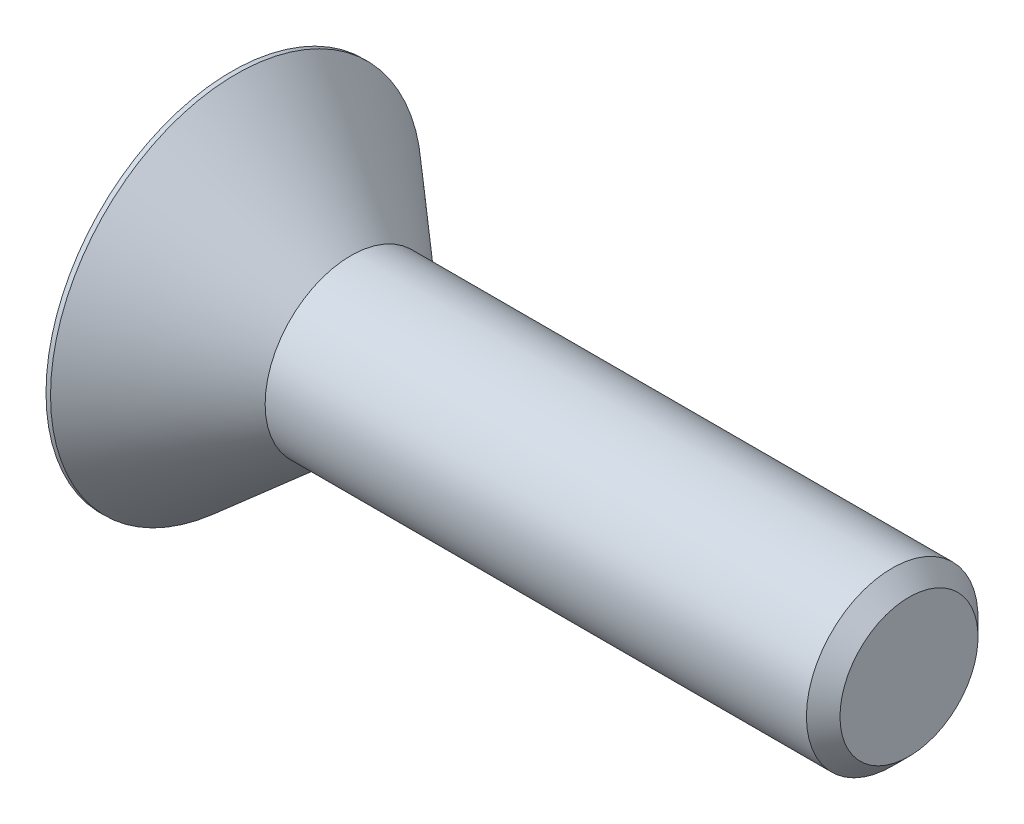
from build123d import *

# Parameters (mm, degrees)
HEX_2_DEPTH = 2.2098


with BuildPart() as part:
    # BodySke → BaseBody (revolve)
    with BuildSketch(Plane.XY, mode=Mode.PRIVATE) as basebody_sk:
        Polygon((0, 0), (0, 5.2197), (0.127, 5.2197), (3.355739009, 2.413), (18.57756, 2.413), (19.05, 1.94056), (19.05, 0), align=None)
    revolve(basebody_sk.sketch.rotate(Axis((0, 0, 0), (1, 0, 0)), 90), axis=Axis((0, 0, 0), (1, 0, 0)))

    # Sketch2 → PreBroach (revolve, cut)
    with BuildSketch(Plane.XY, mode=Mode.PRIVATE) as prebroach_sk:
        Polygon((0, 1.5875), (2.2098, 1.5875), (3.126343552, 0), (0, 0), align=None)
    revolve(prebroach_sk.sketch.rotate(Axis((0, 0, 0), (1, 0, 0)), 90), axis=Axis((0, 0, 0), (1, 0, 0)), mode=Mode.SUBTRACT)

    # Sketch3 → Hex 2 (cut)
    with BuildSketch(Plane.ZY):
        Polygon((-1.5875, -0.916543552), (-1.5875, 0.916543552), (0, 1.833087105), (1.5875, 0.916543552), (1.5875, -0.916543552), (0, -1.833087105), align=None)
    extrude(amount=-HEX_2_DEPTH, mode=Mode.SUBTRACT)


solid = part.part
